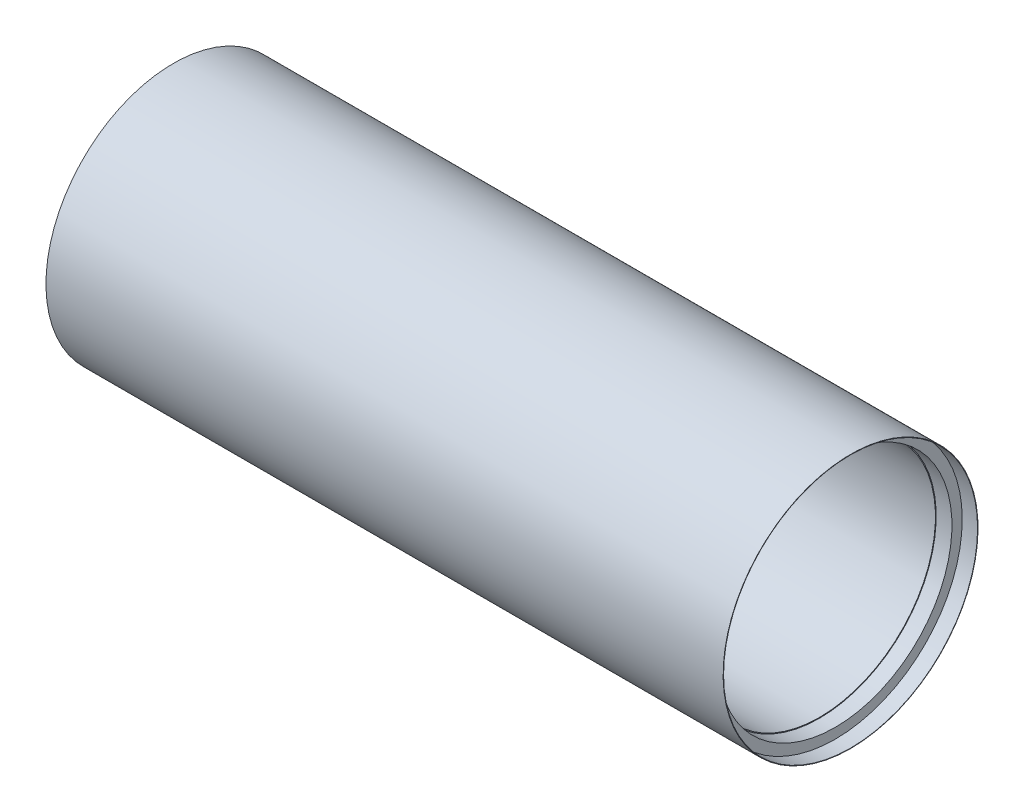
ISO-10303-21;
HEADER;
FILE_DESCRIPTION(('STEP AP214'),'2;1');
FILE_NAME('part.step','',(''),(''),'','','');
FILE_SCHEMA(('AUTOMOTIVE_DESIGN { 1 0 10303 214 1 1 1 1 }'));
ENDSEC;
DATA;
#1=APPLICATION_CONTEXT('core data for automotive mechanical design processes');
#2=APPLICATION_PROTOCOL_DEFINITION('international standard','automotive_design',2000,#1);
#3=PRODUCT_CONTEXT('',#1,'mechanical');
#4=PRODUCT('Part','Part','',(#3));
#5=PRODUCT_RELATED_PRODUCT_CATEGORY('part','',(#4));
#6=PRODUCT_DEFINITION_FORMATION('','',#4);
#7=PRODUCT_DEFINITION_CONTEXT('part definition',#1,'design');
#8=PRODUCT_DEFINITION('design','',#6,#7);
#9=PRODUCT_DEFINITION_SHAPE('','',#8);
#10=(LENGTH_UNIT() NAMED_UNIT(*) SI_UNIT(.MILLI.,.METRE.));
#11=(NAMED_UNIT(*) PLANE_ANGLE_UNIT() SI_UNIT($,.RADIAN.));
#12=(NAMED_UNIT(*) SI_UNIT($,.STERADIAN.) SOLID_ANGLE_UNIT());
#13=UNCERTAINTY_MEASURE_WITH_UNIT(LENGTH_MEASURE(1.E-05),#10,'distance_accuracy_value','');
#14=(GEOMETRIC_REPRESENTATION_CONTEXT(3) GLOBAL_UNCERTAINTY_ASSIGNED_CONTEXT((#13)) GLOBAL_UNIT_ASSIGNED_CONTEXT((#10,
#11,#12)) REPRESENTATION_CONTEXT('',''));
#15=CARTESIAN_POINT('',(0.,0.,0.));
#16=DIRECTION('',(0.,0.,1.));
#17=DIRECTION('',(1.,0.,0.));
#18=AXIS2_PLACEMENT_3D('',#15,#16,#17);
#19=CARTESIAN_POINT('',(427.5582,-4.67209604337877E-11,0.));
#20=DIRECTION('',(1.,0.,0.));
#21=DIRECTION('',(0.,1.,0.));
#22=AXIS2_PLACEMENT_3D('',#19,#20,#21);
#23=PLANE('',#22);
#24=CARTESIAN_POINT('',(427.5582,0.,0.));
#25=DIRECTION('',(-1.,0.,0.));
#26=DIRECTION('',(0.,-1.,0.));
#27=AXIS2_PLACEMENT_3D('',#24,#25,#26);
#28=CIRCLE('',#27,76.7334);
#29=CARTESIAN_POINT('',(427.5582,-76.7334,0.));
#30=VERTEX_POINT('',#29);
#31=EDGE_CURVE('E74',#30,#30,#28,.T.);
#32=ORIENTED_EDGE('',*,*,#31,.T.);
#33=EDGE_LOOP('',(#32));
#34=FACE_BOUND('',#33,.T.);
#35=CARTESIAN_POINT('',(427.5582,0.,0.));
#36=DIRECTION('',(-1.,0.,0.));
#37=DIRECTION('',(0.,-1.,0.));
#38=AXIS2_PLACEMENT_3D('',#35,#36,#37);
#39=CIRCLE('',#38,77.2414);
#40=CARTESIAN_POINT('',(427.5582,-77.2414,0.));
#41=VERTEX_POINT('',#40);
#42=EDGE_CURVE('E10',#41,#41,#39,.T.);
#43=ORIENTED_EDGE('',*,*,#42,.F.);
#44=EDGE_LOOP('',(#43));
#45=FACE_BOUND('',#44,.T.);
#46=ADVANCED_FACE('F34',(#34,#45),#23,.T.);
#47=CARTESIAN_POINT('',(0.,0.,0.));
#48=DIRECTION('',(-1.,0.,0.));
#49=DIRECTION('',(0.,-1.,0.));
#50=AXIS2_PLACEMENT_3D('',#47,#48,#49);
#51=CYLINDRICAL_SURFACE('',#50,77.2414);
#52=ORIENTED_EDGE('',*,*,#42,.T.);
#53=EDGE_LOOP('',(#52));
#54=FACE_BOUND('',#53,.T.);
#55=CARTESIAN_POINT('',(437.9722,0.,0.));
#56=DIRECTION('',(-1.,0.,0.));
#57=DIRECTION('',(0.,-1.,0.));
#58=AXIS2_PLACEMENT_3D('',#55,#56,#57);
#59=CIRCLE('',#58,77.2414);
#60=CARTESIAN_POINT('',(437.9722,-77.2414,0.));
#61=VERTEX_POINT('',#60);
#62=EDGE_CURVE('E40',#61,#61,#59,.T.);
#63=ORIENTED_EDGE('',*,*,#62,.F.);
#64=EDGE_LOOP('',(#63));
#65=FACE_BOUND('',#64,.T.);
#66=ADVANCED_FACE('F136',(#54,#65),#51,.F.);
#67=CARTESIAN_POINT('',(437.9722,0.,0.));
#68=DIRECTION('',(-1.,0.,0.));
#69=DIRECTION('',(0.,-1.,0.));
#70=AXIS2_PLACEMENT_3D('',#67,#68,#69);
#71=PLANE('',#70);
#72=CARTESIAN_POINT('',(437.9722,0.,0.));
#73=DIRECTION('',(-1.,0.,0.));
#74=DIRECTION('',(0.,-1.,0.));
#75=AXIS2_PLACEMENT_3D('',#72,#73,#74);
#76=CIRCLE('',#75,84.0486);
#77=CARTESIAN_POINT('',(437.9722,-84.0486,0.));
#78=VERTEX_POINT('',#77);
#79=EDGE_CURVE('E44',#78,#78,#76,.T.);
#80=ORIENTED_EDGE('',*,*,#79,.F.);
#81=EDGE_LOOP('',(#80));
#82=FACE_BOUND('',#81,.T.);
#83=ORIENTED_EDGE('',*,*,#62,.T.);
#84=EDGE_LOOP('',(#83));
#85=FACE_BOUND('',#84,.T.);
#86=ADVANCED_FACE('F131',(#82,#85),#71,.F.);
#87=CARTESIAN_POINT('',(0.,0.,0.));
#88=DIRECTION('',(-1.,0.,0.));
#89=DIRECTION('',(0.,-1.,0.));
#90=AXIS2_PLACEMENT_3D('',#87,#88,#89);
#91=CYLINDRICAL_SURFACE('',#90,84.0486);
#92=CARTESIAN_POINT('',(448.1322,0.,0.));
#93=DIRECTION('',(-1.,0.,0.));
#94=DIRECTION('',(0.,-1.,0.));
#95=AXIS2_PLACEMENT_3D('',#92,#93,#94);
#96=CIRCLE('',#95,84.0486);
#97=CARTESIAN_POINT('',(448.1322,-84.0486,0.));
#98=VERTEX_POINT('',#97);
#99=EDGE_CURVE('E48',#98,#98,#96,.T.);
#100=ORIENTED_EDGE('',*,*,#99,.F.);
#101=EDGE_LOOP('',(#100));
#102=FACE_BOUND('',#101,.T.);
#103=ORIENTED_EDGE('',*,*,#79,.T.);
#104=EDGE_LOOP('',(#103));
#105=FACE_BOUND('',#104,.T.);
#106=ADVANCED_FACE('F125',(#102,#105),#91,.F.);
#107=CARTESIAN_POINT('',(448.1322,0.,0.));
#108=DIRECTION('',(-1.,0.,0.));
#109=DIRECTION('',(0.,-1.,0.));
#110=AXIS2_PLACEMENT_3D('',#107,#108,#109);
#111=PLANE('',#110);
#112=CARTESIAN_POINT('',(448.1322,0.,0.));
#113=DIRECTION('',(-1.,0.,0.));
#114=DIRECTION('',(0.,-1.,0.));
#115=AXIS2_PLACEMENT_3D('',#112,#113,#114);
#116=CIRCLE('',#115,84.3534);
#117=CARTESIAN_POINT('',(448.1322,-84.3534,0.));
#118=VERTEX_POINT('',#117);
#119=EDGE_CURVE('E53',#118,#118,#116,.T.);
#120=ORIENTED_EDGE('',*,*,#119,.F.);
#121=EDGE_LOOP('',(#120));
#122=FACE_BOUND('',#121,.T.);
#123=ORIENTED_EDGE('',*,*,#99,.T.);
#124=EDGE_LOOP('',(#123));
#125=FACE_BOUND('',#124,.T.);
#126=ADVANCED_FACE('F119',(#122,#125),#111,.F.);
#127=CARTESIAN_POINT('',(0.,0.,0.));
#128=DIRECTION('',(-1.,0.,0.));
#129=DIRECTION('',(0.,-1.,0.));
#130=AXIS2_PLACEMENT_3D('',#127,#128,#129);
#131=CYLINDRICAL_SURFACE('',#130,84.3534);
#132=CARTESIAN_POINT('',(0.,0.,0.));
#133=DIRECTION('',(-1.,0.,0.));
#134=DIRECTION('',(0.,-1.,0.));
#135=AXIS2_PLACEMENT_3D('',#132,#133,#134);
#136=CIRCLE('',#135,84.3534);
#137=CARTESIAN_POINT('',(0.,-84.3534,0.));
#138=VERTEX_POINT('',#137);
#139=EDGE_CURVE('E56',#138,#138,#136,.T.);
#140=ORIENTED_EDGE('',*,*,#139,.F.);
#141=EDGE_LOOP('',(#140));
#142=FACE_BOUND('',#141,.T.);
#143=ORIENTED_EDGE('',*,*,#119,.T.);
#144=EDGE_LOOP('',(#143));
#145=FACE_BOUND('',#144,.T.);
#146=ADVANCED_FACE('F113',(#142,#145),#131,.T.);
#147=CARTESIAN_POINT('',(0.,0.,0.));
#148=DIRECTION('',(1.,0.,0.));
#149=DIRECTION('',(0.,1.,0.));
#150=AXIS2_PLACEMENT_3D('',#147,#148,#149);
#151=PLANE('',#150);
#152=CARTESIAN_POINT('',(0.,0.,0.));
#153=DIRECTION('',(-1.,0.,0.));
#154=DIRECTION('',(0.,-1.,0.));
#155=AXIS2_PLACEMENT_3D('',#152,#153,#154);
#156=CIRCLE('',#155,83.9724);
#157=CARTESIAN_POINT('',(0.,-83.9724,0.));
#158=VERTEX_POINT('',#157);
#159=EDGE_CURVE('E59',#158,#158,#156,.T.);
#160=ORIENTED_EDGE('',*,*,#159,.F.);
#161=EDGE_LOOP('',(#160));
#162=FACE_BOUND('',#161,.T.);
#163=ORIENTED_EDGE('',*,*,#139,.T.);
#164=EDGE_LOOP('',(#163));
#165=FACE_BOUND('',#164,.T.);
#166=ADVANCED_FACE('F107',(#162,#165),#151,.F.);
#167=CARTESIAN_POINT('',(0.,0.,0.));
#168=DIRECTION('',(-1.,0.,0.));
#169=DIRECTION('',(0.,-1.,0.));
#170=AXIS2_PLACEMENT_3D('',#167,#168,#169);
#171=CYLINDRICAL_SURFACE('',#170,83.9724);
#172=CARTESIAN_POINT('',(10.16,0.,0.));
#173=DIRECTION('',(-1.,0.,0.));
#174=DIRECTION('',(0.,-1.,0.));
#175=AXIS2_PLACEMENT_3D('',#172,#173,#174);
#176=CIRCLE('',#175,83.9724);
#177=CARTESIAN_POINT('',(10.16,-83.9724,0.));
#178=VERTEX_POINT('',#177);
#179=EDGE_CURVE('E62',#178,#178,#176,.T.);
#180=ORIENTED_EDGE('',*,*,#179,.F.);
#181=EDGE_LOOP('',(#180));
#182=FACE_BOUND('',#181,.T.);
#183=ORIENTED_EDGE('',*,*,#159,.T.);
#184=EDGE_LOOP('',(#183));
#185=FACE_BOUND('',#184,.T.);
#186=ADVANCED_FACE('F101',(#182,#185),#171,.F.);
#187=CARTESIAN_POINT('',(10.16,0.,0.));
#188=DIRECTION('',(1.,0.,0.));
#189=DIRECTION('',(0.,1.,0.));
#190=AXIS2_PLACEMENT_3D('',#187,#188,#189);
#191=PLANE('',#190);
#192=CARTESIAN_POINT('',(10.16,0.,0.));
#193=DIRECTION('',(-1.,0.,0.));
#194=DIRECTION('',(0.,-1.,0.));
#195=AXIS2_PLACEMENT_3D('',#192,#193,#194);
#196=CIRCLE('',#195,77.2414);
#197=CARTESIAN_POINT('',(10.16,-77.2414,0.));
#198=VERTEX_POINT('',#197);
#199=EDGE_CURVE('E65',#198,#198,#196,.T.);
#200=ORIENTED_EDGE('',*,*,#199,.F.);
#201=EDGE_LOOP('',(#200));
#202=FACE_BOUND('',#201,.T.);
#203=ORIENTED_EDGE('',*,*,#179,.T.);
#204=EDGE_LOOP('',(#203));
#205=FACE_BOUND('',#204,.T.);
#206=ADVANCED_FACE('F95',(#202,#205),#191,.F.);
#207=CARTESIAN_POINT('',(0.,0.,0.));
#208=DIRECTION('',(-1.,0.,0.));
#209=DIRECTION('',(0.,-1.,0.));
#210=AXIS2_PLACEMENT_3D('',#207,#208,#209);
#211=CYLINDRICAL_SURFACE('',#210,77.2414);
#212=CARTESIAN_POINT('',(20.574,0.,0.));
#213=DIRECTION('',(-1.,0.,0.));
#214=DIRECTION('',(0.,-1.,0.));
#215=AXIS2_PLACEMENT_3D('',#212,#213,#214);
#216=CIRCLE('',#215,77.2414);
#217=CARTESIAN_POINT('',(20.574,-77.2414,0.));
#218=VERTEX_POINT('',#217);
#219=EDGE_CURVE('E68',#218,#218,#216,.T.);
#220=ORIENTED_EDGE('',*,*,#219,.F.);
#221=EDGE_LOOP('',(#220));
#222=FACE_BOUND('',#221,.T.);
#223=ORIENTED_EDGE('',*,*,#199,.T.);
#224=EDGE_LOOP('',(#223));
#225=FACE_BOUND('',#224,.T.);
#226=ADVANCED_FACE('F89',(#222,#225),#211,.F.);
#227=CARTESIAN_POINT('',(20.574,0.,0.));
#228=DIRECTION('',(1.,0.,0.));
#229=DIRECTION('',(0.,1.,0.));
#230=AXIS2_PLACEMENT_3D('',#227,#228,#229);
#231=PLANE('',#230);
#232=CARTESIAN_POINT('',(20.574,0.,0.));
#233=DIRECTION('',(-1.,0.,0.));
#234=DIRECTION('',(0.,-1.,0.));
#235=AXIS2_PLACEMENT_3D('',#232,#233,#234);
#236=CIRCLE('',#235,76.7334);
#237=CARTESIAN_POINT('',(20.574,-76.7334,0.));
#238=VERTEX_POINT('',#237);
#239=EDGE_CURVE('E71',#238,#238,#236,.T.);
#240=ORIENTED_EDGE('',*,*,#239,.F.);
#241=EDGE_LOOP('',(#240));
#242=FACE_BOUND('',#241,.T.);
#243=ORIENTED_EDGE('',*,*,#219,.T.);
#244=EDGE_LOOP('',(#243));
#245=FACE_BOUND('',#244,.T.);
#246=ADVANCED_FACE('F83',(#242,#245),#231,.F.);
#247=CARTESIAN_POINT('',(0.,0.,0.));
#248=DIRECTION('',(-1.,0.,0.));
#249=DIRECTION('',(0.,-1.,0.));
#250=AXIS2_PLACEMENT_3D('',#247,#248,#249);
#251=CYLINDRICAL_SURFACE('',#250,76.7334);
#252=ORIENTED_EDGE('',*,*,#31,.F.);
#253=EDGE_LOOP('',(#252));
#254=FACE_BOUND('',#253,.T.);
#255=ORIENTED_EDGE('',*,*,#239,.T.);
#256=EDGE_LOOP('',(#255));
#257=FACE_BOUND('',#256,.T.);
#258=ADVANCED_FACE('F80',(#254,#257),#251,.F.);
#259=CLOSED_SHELL('',(#46,#66,#86,#106,#126,#146,#166,#186,#206,#226,#246,#258));
#260=MANIFOLD_SOLID_BREP('B2',#259);
#261=ADVANCED_BREP_SHAPE_REPRESENTATION('',(#18,#260),#14);
#262=SHAPE_DEFINITION_REPRESENTATION(#9,#261);
ENDSEC;
END-ISO-10303-21;
